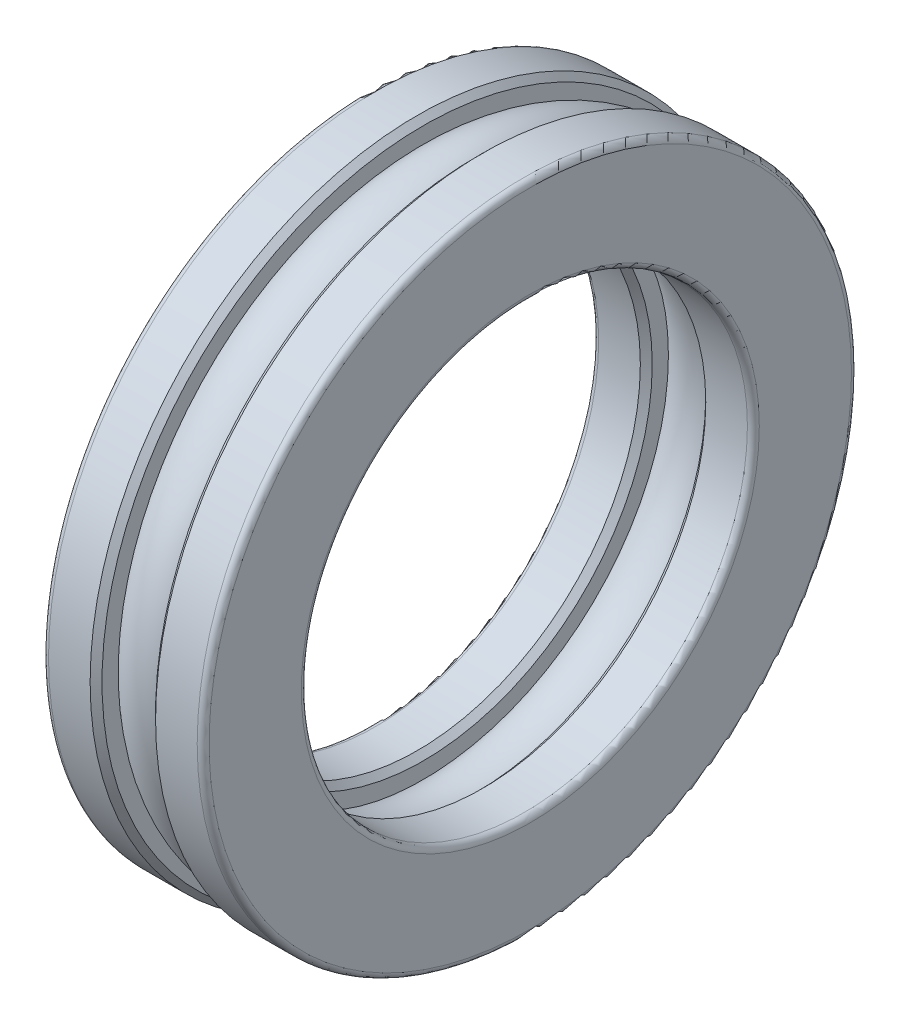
ISO-10303-21;
HEADER;
FILE_DESCRIPTION(('STEP AP214'),'2;1');
FILE_NAME('part.step','',(''),(''),'','','');
FILE_SCHEMA(('AUTOMOTIVE_DESIGN { 1 0 10303 214 1 1 1 1 }'));
ENDSEC;
DATA;
#1=APPLICATION_CONTEXT('core data for automotive mechanical design processes');
#2=APPLICATION_PROTOCOL_DEFINITION('international standard','automotive_design',2000,#1);
#3=PRODUCT_CONTEXT('',#1,'mechanical');
#4=PRODUCT('Part','Part','',(#3));
#5=PRODUCT_RELATED_PRODUCT_CATEGORY('part','',(#4));
#6=PRODUCT_DEFINITION_FORMATION('','',#4);
#7=PRODUCT_DEFINITION_CONTEXT('part definition',#1,'design');
#8=PRODUCT_DEFINITION('design','',#6,#7);
#9=PRODUCT_DEFINITION_SHAPE('','',#8);
#10=(LENGTH_UNIT() NAMED_UNIT(*) SI_UNIT(.MILLI.,.METRE.));
#11=(NAMED_UNIT(*) PLANE_ANGLE_UNIT() SI_UNIT($,.RADIAN.));
#12=(NAMED_UNIT(*) SI_UNIT($,.STERADIAN.) SOLID_ANGLE_UNIT());
#13=UNCERTAINTY_MEASURE_WITH_UNIT(LENGTH_MEASURE(1.E-05),#10,'distance_accuracy_value','');
#14=(GEOMETRIC_REPRESENTATION_CONTEXT(3) GLOBAL_UNCERTAINTY_ASSIGNED_CONTEXT((#13)) GLOBAL_UNIT_ASSIGNED_CONTEXT((#10,
#11,#12)) REPRESENTATION_CONTEXT('',''));
#15=CARTESIAN_POINT('',(0.,0.,0.));
#16=DIRECTION('',(0.,0.,1.));
#17=DIRECTION('',(1.,0.,0.));
#18=AXIS2_PLACEMENT_3D('',#15,#16,#17);
#19=CARTESIAN_POINT('',(13.5,0.,0.));
#20=DIRECTION('',(-1.,0.,0.));
#21=DIRECTION('',(0.,0.,1.));
#22=AXIS2_PLACEMENT_3D('',#19,#20,#21);
#23=TOROIDAL_SURFACE('',#22,46.25,6.75);
#24=CARTESIAN_POINT('',(17.9999999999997,0.,0.));
#25=DIRECTION('',(1.,0.,0.));
#26=DIRECTION('',(0.,0.,-1.));
#27=AXIS2_PLACEMENT_3D('',#24,#25,#26);
#28=CIRCLE('',#27,51.2811529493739);
#29=CARTESIAN_POINT('',(17.9999999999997,0.,-51.2811529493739));
#30=VERTEX_POINT('',#29);
#31=EDGE_CURVE('E91',#30,#30,#28,.T.);
#32=ORIENTED_EDGE('',*,*,#31,.F.);
#33=EDGE_LOOP('',(#32));
#34=FACE_BOUND('',#33,.T.);
#35=CARTESIAN_POINT('',(9.00000000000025,0.,0.));
#36=DIRECTION('',(1.,0.,0.));
#37=DIRECTION('',(0.,0.,-1.));
#38=AXIS2_PLACEMENT_3D('',#35,#36,#37);
#39=CIRCLE('',#38,51.2811529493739);
#40=CARTESIAN_POINT('',(9.00000000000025,0.,-51.2811529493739));
#41=VERTEX_POINT('',#40);
#42=EDGE_CURVE('E61',#41,#41,#39,.T.);
#43=ORIENTED_EDGE('',*,*,#42,.T.);
#44=EDGE_LOOP('',(#43));
#45=FACE_BOUND('',#44,.T.);
#46=ADVANCED_FACE('F32',(#34,#45),#23,.T.);
#47=CARTESIAN_POINT('',(8.,0.,0.));
#48=DIRECTION('',(1.,0.,0.));
#49=DIRECTION('',(0.,0.,-1.));
#50=AXIS2_PLACEMENT_3D('',#47,#48,#49);
#51=CONICAL_SURFACE('',#50,37.5,0.785398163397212);
#52=CARTESIAN_POINT('',(9.00000000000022,0.,0.));
#53=DIRECTION('',(1.,0.,0.));
#54=DIRECTION('',(0.,0.,-1.));
#55=AXIS2_PLACEMENT_3D('',#52,#53,#54);
#56=CIRCLE('',#55,38.4999999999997);
#57=CARTESIAN_POINT('',(9.00000000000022,0.,-38.4999999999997));
#58=VERTEX_POINT('',#57);
#59=EDGE_CURVE('E64',#58,#58,#56,.T.);
#60=ORIENTED_EDGE('',*,*,#59,.T.);
#61=EDGE_LOOP('',(#60));
#62=FACE_BOUND('',#61,.T.);
#63=CARTESIAN_POINT('',(8.,0.,0.));
#64=DIRECTION('',(1.,0.,0.));
#65=DIRECTION('',(0.,0.,-1.));
#66=AXIS2_PLACEMENT_3D('',#63,#64,#65);
#67=CIRCLE('',#66,37.5);
#68=CARTESIAN_POINT('',(8.,0.,-37.5));
#69=VERTEX_POINT('',#68);
#70=EDGE_CURVE('E10',#69,#69,#67,.T.);
#71=ORIENTED_EDGE('',*,*,#70,.F.);
#72=EDGE_LOOP('',(#71));
#73=FACE_BOUND('',#72,.T.);
#74=ADVANCED_FACE('F34',(#62,#73),#51,.F.);
#75=CARTESIAN_POINT('',(0.,0.,0.));
#76=DIRECTION('',(1.,0.,0.));
#77=DIRECTION('',(0.,0.,-1.));
#78=AXIS2_PLACEMENT_3D('',#75,#76,#77);
#79=CYLINDRICAL_SURFACE('',#78,37.4999999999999);
#80=ORIENTED_EDGE('',*,*,#70,.T.);
#81=EDGE_LOOP('',(#80));
#82=FACE_BOUND('',#81,.T.);
#83=CARTESIAN_POINT('',(1.00000000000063,0.,0.));
#84=DIRECTION('',(1.,0.,0.));
#85=DIRECTION('',(0.,0.,-1.));
#86=AXIS2_PLACEMENT_3D('',#83,#84,#85);
#87=CIRCLE('',#86,37.4999999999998);
#88=CARTESIAN_POINT('',(1.00000000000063,0.,-37.4999999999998));
#89=VERTEX_POINT('',#88);
#90=EDGE_CURVE('E39',#89,#89,#87,.T.);
#91=ORIENTED_EDGE('',*,*,#90,.F.);
#92=EDGE_LOOP('',(#91));
#93=FACE_BOUND('',#92,.T.);
#94=ADVANCED_FACE('F186',(#82,#93),#79,.F.);
#95=CARTESIAN_POINT('',(1.00000000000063,0.,0.));
#96=DIRECTION('',(1.,0.,0.));
#97=DIRECTION('',(0.,0.,-1.));
#98=AXIS2_PLACEMENT_3D('',#95,#96,#97);
#99=TOROIDAL_SURFACE('',#98,38.4999999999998,1.);
#100=ORIENTED_EDGE('',*,*,#90,.T.);
#101=EDGE_LOOP('',(#100));
#102=FACE_BOUND('',#101,.T.);
#103=CARTESIAN_POINT('',(6.31656185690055E-13,0.,0.));
#104=DIRECTION('',(1.,0.,0.));
#105=DIRECTION('',(0.,0.,-1.));
#106=AXIS2_PLACEMENT_3D('',#103,#104,#105);
#107=CIRCLE('',#106,38.4999999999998);
#108=CARTESIAN_POINT('',(6.31656185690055E-13,0.,-38.4999999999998));
#109=VERTEX_POINT('',#108);
#110=EDGE_CURVE('E43',#109,#109,#107,.T.);
#111=ORIENTED_EDGE('',*,*,#110,.F.);
#112=EDGE_LOOP('',(#111));
#113=FACE_BOUND('',#112,.T.);
#114=ADVANCED_FACE('F183',(#102,#113),#99,.T.);
#115=CARTESIAN_POINT('',(6.30463563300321E-13,53.9999999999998,0.));
#116=DIRECTION('',(-1.,0.,0.));
#117=DIRECTION('',(0.,0.,1.));
#118=AXIS2_PLACEMENT_3D('',#115,#116,#117);
#119=PLANE('',#118);
#120=ORIENTED_EDGE('',*,*,#110,.T.);
#121=EDGE_LOOP('',(#120));
#122=FACE_BOUND('',#121,.T.);
#123=CARTESIAN_POINT('',(6.29270940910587E-13,0.,0.));
#124=DIRECTION('',(1.,0.,0.));
#125=DIRECTION('',(0.,0.,-1.));
#126=AXIS2_PLACEMENT_3D('',#123,#124,#125);
#127=CIRCLE('',#126,53.9999999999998);
#128=CARTESIAN_POINT('',(6.29270940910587E-13,0.,-53.9999999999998));
#129=VERTEX_POINT('',#128);
#130=EDGE_CURVE('E47',#129,#129,#127,.T.);
#131=ORIENTED_EDGE('',*,*,#130,.F.);
#132=EDGE_LOOP('',(#131));
#133=FACE_BOUND('',#132,.T.);
#134=ADVANCED_FACE('F179',(#122,#133),#119,.T.);
#135=CARTESIAN_POINT('',(1.00000000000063,0.,0.));
#136=DIRECTION('',(1.,0.,0.));
#137=DIRECTION('',(0.,0.,-1.));
#138=AXIS2_PLACEMENT_3D('',#135,#136,#137);
#139=TOROIDAL_SURFACE('',#138,53.9999999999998,1.);
#140=ORIENTED_EDGE('',*,*,#130,.T.);
#141=EDGE_LOOP('',(#140));
#142=FACE_BOUND('',#141,.T.);
#143=CARTESIAN_POINT('',(1.00000000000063,0.,0.));
#144=DIRECTION('',(1.,0.,0.));
#145=DIRECTION('',(0.,0.,-1.));
#146=AXIS2_PLACEMENT_3D('',#143,#144,#145);
#147=CIRCLE('',#146,54.9999999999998);
#148=CARTESIAN_POINT('',(1.00000000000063,0.,-54.9999999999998));
#149=VERTEX_POINT('',#148);
#150=EDGE_CURVE('E52',#149,#149,#147,.T.);
#151=ORIENTED_EDGE('',*,*,#150,.F.);
#152=EDGE_LOOP('',(#151));
#153=FACE_BOUND('',#152,.T.);
#154=ADVANCED_FACE('F175',(#142,#153),#139,.T.);
#155=CARTESIAN_POINT('',(0.,0.,0.));
#156=DIRECTION('',(1.,0.,0.));
#157=DIRECTION('',(0.,0.,-1.));
#158=AXIS2_PLACEMENT_3D('',#155,#156,#157);
#159=CYLINDRICAL_SURFACE('',#158,54.9999999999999);
#160=ORIENTED_EDGE('',*,*,#150,.T.);
#161=EDGE_LOOP('',(#160));
#162=FACE_BOUND('',#161,.T.);
#163=CARTESIAN_POINT('',(7.99999999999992,0.,0.));
#164=DIRECTION('',(1.,0.,0.));
#165=DIRECTION('',(0.,0.,-1.));
#166=AXIS2_PLACEMENT_3D('',#163,#164,#165);
#167=CIRCLE('',#166,54.9999999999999);
#168=CARTESIAN_POINT('',(7.99999999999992,0.,-54.9999999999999));
#169=VERTEX_POINT('',#168);
#170=EDGE_CURVE('E55',#169,#169,#167,.T.);
#171=ORIENTED_EDGE('',*,*,#170,.F.);
#172=EDGE_LOOP('',(#171));
#173=FACE_BOUND('',#172,.T.);
#174=ADVANCED_FACE('F169',(#162,#173),#159,.T.);
#175=CARTESIAN_POINT('',(9.00000000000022,0.,0.));
#176=DIRECTION('',(-1.,0.,0.));
#177=DIRECTION('',(0.,0.,1.));
#178=AXIS2_PLACEMENT_3D('',#175,#176,#177);
#179=CONICAL_SURFACE('',#178,54.0000000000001,0.785398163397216);
#180=ORIENTED_EDGE('',*,*,#170,.T.);
#181=EDGE_LOOP('',(#180));
#182=FACE_BOUND('',#181,.T.);
#183=CARTESIAN_POINT('',(9.00000000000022,0.,0.));
#184=DIRECTION('',(1.,0.,0.));
#185=DIRECTION('',(0.,0.,-1.));
#186=AXIS2_PLACEMENT_3D('',#183,#184,#185);
#187=CIRCLE('',#186,54.0000000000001);
#188=CARTESIAN_POINT('',(9.00000000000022,0.,-54.0000000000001));
#189=VERTEX_POINT('',#188);
#190=EDGE_CURVE('E58',#189,#189,#187,.T.);
#191=ORIENTED_EDGE('',*,*,#190,.F.);
#192=EDGE_LOOP('',(#191));
#193=FACE_BOUND('',#192,.T.);
#194=ADVANCED_FACE('F160',(#182,#193),#179,.T.);
#195=CARTESIAN_POINT('',(9.00000000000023,51.2811529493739,0.));
#196=DIRECTION('',(1.,0.,0.));
#197=DIRECTION('',(0.,0.,-1.));
#198=AXIS2_PLACEMENT_3D('',#195,#196,#197);
#199=PLANE('',#198);
#200=ORIENTED_EDGE('',*,*,#190,.T.);
#201=EDGE_LOOP('',(#200));
#202=FACE_BOUND('',#201,.T.);
#203=ORIENTED_EDGE('',*,*,#42,.F.);
#204=EDGE_LOOP('',(#203));
#205=FACE_BOUND('',#204,.T.);
#206=ADVANCED_FACE('F157',(#202,#205),#199,.T.);
#207=CARTESIAN_POINT('',(9.00000000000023,38.4999999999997,0.));
#208=DIRECTION('',(1.,0.,0.));
#209=DIRECTION('',(0.,0.,-1.));
#210=AXIS2_PLACEMENT_3D('',#207,#208,#209);
#211=PLANE('',#210);
#212=CARTESIAN_POINT('',(9.00000000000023,0.,0.));
#213=DIRECTION('',(-1.,0.,0.));
#214=DIRECTION('',(0.,0.,1.));
#215=AXIS2_PLACEMENT_3D('',#212,#213,#214);
#216=CIRCLE('',#215,41.2188470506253);
#217=CARTESIAN_POINT('',(9.00000000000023,0.,41.2188470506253));
#218=VERTEX_POINT('',#217);
#219=EDGE_CURVE('E67',#218,#218,#216,.F.);
#220=ORIENTED_EDGE('',*,*,#219,.T.);
#221=EDGE_LOOP('',(#220));
#222=FACE_BOUND('',#221,.T.);
#223=ORIENTED_EDGE('',*,*,#59,.F.);
#224=EDGE_LOOP('',(#223));
#225=FACE_BOUND('',#224,.T.);
#226=ADVANCED_FACE('F159',(#222,#225),#211,.T.);
#227=CARTESIAN_POINT('',(17.9999999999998,0.,0.));
#228=DIRECTION('',(1.,0.,0.));
#229=DIRECTION('',(0.,0.,-1.));
#230=AXIS2_PLACEMENT_3D('',#227,#228,#229);
#231=CIRCLE('',#230,41.2188470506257);
#232=CARTESIAN_POINT('',(17.9999999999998,0.,-41.2188470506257));
#233=VERTEX_POINT('',#232);
#234=EDGE_CURVE('E94',#233,#233,#231,.T.);
#235=ORIENTED_EDGE('',*,*,#234,.T.);
#236=EDGE_LOOP('',(#235));
#237=FACE_BOUND('',#236,.T.);
#238=ORIENTED_EDGE('',*,*,#219,.F.);
#239=EDGE_LOOP('',(#238));
#240=FACE_BOUND('',#239,.T.);
#241=ADVANCED_FACE('F107',(#237,#240),#23,.T.);
#242=CARTESIAN_POINT('',(19.,0.,0.));
#243=DIRECTION('',(-1.,0.,0.));
#244=DIRECTION('',(0.,0.,-1.));
#245=AXIS2_PLACEMENT_3D('',#242,#243,#244);
#246=CONICAL_SURFACE('',#245,37.5,0.785398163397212);
#247=CARTESIAN_POINT('',(17.9999999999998,0.,0.));
#248=DIRECTION('',(1.,0.,0.));
#249=DIRECTION('',(0.,0.,-1.));
#250=AXIS2_PLACEMENT_3D('',#247,#248,#249);
#251=CIRCLE('',#250,38.4999999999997);
#252=CARTESIAN_POINT('',(17.9999999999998,0.,-38.4999999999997));
#253=VERTEX_POINT('',#252);
#254=EDGE_CURVE('E97',#253,#253,#251,.T.);
#255=ORIENTED_EDGE('',*,*,#254,.F.);
#256=EDGE_LOOP('',(#255));
#257=FACE_BOUND('',#256,.T.);
#258=CARTESIAN_POINT('',(19.,0.,0.));
#259=DIRECTION('',(1.,0.,0.));
#260=DIRECTION('',(0.,0.,-1.));
#261=AXIS2_PLACEMENT_3D('',#258,#259,#260);
#262=CIRCLE('',#261,37.5);
#263=CARTESIAN_POINT('',(19.,0.,-37.5));
#264=VERTEX_POINT('',#263);
#265=EDGE_CURVE('E70',#264,#264,#262,.T.);
#266=ORIENTED_EDGE('',*,*,#265,.T.);
#267=EDGE_LOOP('',(#266));
#268=FACE_BOUND('',#267,.T.);
#269=ADVANCED_FACE('F103',(#257,#268),#246,.F.);
#270=CARTESIAN_POINT('',(27.,0.,0.));
#271=DIRECTION('',(-1.,0.,0.));
#272=DIRECTION('',(0.,0.,-1.));
#273=AXIS2_PLACEMENT_3D('',#270,#271,#272);
#274=CYLINDRICAL_SURFACE('',#273,37.4999999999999);
#275=ORIENTED_EDGE('',*,*,#265,.F.);
#276=EDGE_LOOP('',(#275));
#277=FACE_BOUND('',#276,.T.);
#278=CARTESIAN_POINT('',(25.9999999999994,0.,0.));
#279=DIRECTION('',(1.,0.,0.));
#280=DIRECTION('',(0.,0.,-1.));
#281=AXIS2_PLACEMENT_3D('',#278,#279,#280);
#282=CIRCLE('',#281,37.4999999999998);
#283=CARTESIAN_POINT('',(25.9999999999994,0.,-37.4999999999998));
#284=VERTEX_POINT('',#283);
#285=EDGE_CURVE('E73',#284,#284,#282,.T.);
#286=ORIENTED_EDGE('',*,*,#285,.T.);
#287=EDGE_LOOP('',(#286));
#288=FACE_BOUND('',#287,.T.);
#289=ADVANCED_FACE('F106',(#277,#288),#274,.F.);
#290=CARTESIAN_POINT('',(25.9999999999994,0.,0.));
#291=DIRECTION('',(-1.,0.,0.));
#292=DIRECTION('',(0.,0.,-1.));
#293=AXIS2_PLACEMENT_3D('',#290,#291,#292);
#294=TOROIDAL_SURFACE('',#293,38.4999999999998,1.);
#295=ORIENTED_EDGE('',*,*,#285,.F.);
#296=EDGE_LOOP('',(#295));
#297=FACE_BOUND('',#296,.T.);
#298=CARTESIAN_POINT('',(26.9999999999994,0.,0.));
#299=DIRECTION('',(1.,0.,0.));
#300=DIRECTION('',(0.,0.,-1.));
#301=AXIS2_PLACEMENT_3D('',#298,#299,#300);
#302=CIRCLE('',#301,38.4999999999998);
#303=CARTESIAN_POINT('',(26.9999999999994,0.,-38.4999999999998));
#304=VERTEX_POINT('',#303);
#305=EDGE_CURVE('E76',#304,#304,#302,.T.);
#306=ORIENTED_EDGE('',*,*,#305,.T.);
#307=EDGE_LOOP('',(#306));
#308=FACE_BOUND('',#307,.T.);
#309=ADVANCED_FACE('F113',(#297,#308),#294,.T.);
#310=CARTESIAN_POINT('',(26.9999999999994,53.9999999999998,0.));
#311=DIRECTION('',(1.,0.,0.));
#312=DIRECTION('',(0.,0.,1.));
#313=AXIS2_PLACEMENT_3D('',#310,#311,#312);
#314=PLANE('',#313);
#315=ORIENTED_EDGE('',*,*,#305,.F.);
#316=EDGE_LOOP('',(#315));
#317=FACE_BOUND('',#316,.T.);
#318=CARTESIAN_POINT('',(26.9999999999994,0.,0.));
#319=DIRECTION('',(1.,0.,0.));
#320=DIRECTION('',(0.,0.,-1.));
#321=AXIS2_PLACEMENT_3D('',#318,#319,#320);
#322=CIRCLE('',#321,53.9999999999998);
#323=CARTESIAN_POINT('',(26.9999999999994,0.,-53.9999999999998));
#324=VERTEX_POINT('',#323);
#325=EDGE_CURVE('E79',#324,#324,#322,.T.);
#326=ORIENTED_EDGE('',*,*,#325,.T.);
#327=EDGE_LOOP('',(#326));
#328=FACE_BOUND('',#327,.T.);
#329=ADVANCED_FACE('F119',(#317,#328),#314,.T.);
#330=CARTESIAN_POINT('',(25.9999999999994,0.,0.));
#331=DIRECTION('',(-1.,0.,0.));
#332=DIRECTION('',(0.,0.,-1.));
#333=AXIS2_PLACEMENT_3D('',#330,#331,#332);
#334=TOROIDAL_SURFACE('',#333,53.9999999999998,1.);
#335=ORIENTED_EDGE('',*,*,#325,.F.);
#336=EDGE_LOOP('',(#335));
#337=FACE_BOUND('',#336,.T.);
#338=CARTESIAN_POINT('',(25.9999999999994,0.,0.));
#339=DIRECTION('',(1.,0.,0.));
#340=DIRECTION('',(0.,0.,-1.));
#341=AXIS2_PLACEMENT_3D('',#338,#339,#340);
#342=CIRCLE('',#341,54.9999999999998);
#343=CARTESIAN_POINT('',(25.9999999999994,0.,-54.9999999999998));
#344=VERTEX_POINT('',#343);
#345=EDGE_CURVE('E82',#344,#344,#342,.T.);
#346=ORIENTED_EDGE('',*,*,#345,.T.);
#347=EDGE_LOOP('',(#346));
#348=FACE_BOUND('',#347,.T.);
#349=ADVANCED_FACE('F125',(#337,#348),#334,.T.);
#350=CARTESIAN_POINT('',(27.,0.,0.));
#351=DIRECTION('',(-1.,0.,0.));
#352=DIRECTION('',(0.,0.,-1.));
#353=AXIS2_PLACEMENT_3D('',#350,#351,#352);
#354=CYLINDRICAL_SURFACE('',#353,54.9999999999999);
#355=ORIENTED_EDGE('',*,*,#345,.F.);
#356=EDGE_LOOP('',(#355));
#357=FACE_BOUND('',#356,.T.);
#358=CARTESIAN_POINT('',(19.0000000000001,0.,0.));
#359=DIRECTION('',(1.,0.,0.));
#360=DIRECTION('',(0.,0.,-1.));
#361=AXIS2_PLACEMENT_3D('',#358,#359,#360);
#362=CIRCLE('',#361,54.9999999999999);
#363=CARTESIAN_POINT('',(19.0000000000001,0.,-54.9999999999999));
#364=VERTEX_POINT('',#363);
#365=EDGE_CURVE('E85',#364,#364,#362,.T.);
#366=ORIENTED_EDGE('',*,*,#365,.T.);
#367=EDGE_LOOP('',(#366));
#368=FACE_BOUND('',#367,.T.);
#369=ADVANCED_FACE('F131',(#357,#368),#354,.T.);
#370=CARTESIAN_POINT('',(17.9999999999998,0.,0.));
#371=DIRECTION('',(1.,0.,0.));
#372=DIRECTION('',(0.,0.,1.));
#373=AXIS2_PLACEMENT_3D('',#370,#371,#372);
#374=CONICAL_SURFACE('',#373,54.0000000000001,0.785398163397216);
#375=ORIENTED_EDGE('',*,*,#365,.F.);
#376=EDGE_LOOP('',(#375));
#377=FACE_BOUND('',#376,.T.);
#378=CARTESIAN_POINT('',(17.9999999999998,0.,0.));
#379=DIRECTION('',(1.,0.,0.));
#380=DIRECTION('',(0.,0.,-1.));
#381=AXIS2_PLACEMENT_3D('',#378,#379,#380);
#382=CIRCLE('',#381,54.0000000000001);
#383=CARTESIAN_POINT('',(17.9999999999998,0.,-54.0000000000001));
#384=VERTEX_POINT('',#383);
#385=EDGE_CURVE('E88',#384,#384,#382,.T.);
#386=ORIENTED_EDGE('',*,*,#385,.T.);
#387=EDGE_LOOP('',(#386));
#388=FACE_BOUND('',#387,.T.);
#389=ADVANCED_FACE('F137',(#377,#388),#374,.T.);
#390=CARTESIAN_POINT('',(17.9999999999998,51.2811529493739,0.));
#391=DIRECTION('',(-1.,0.,0.));
#392=DIRECTION('',(0.,0.,-1.));
#393=AXIS2_PLACEMENT_3D('',#390,#391,#392);
#394=PLANE('',#393);
#395=ORIENTED_EDGE('',*,*,#385,.F.);
#396=EDGE_LOOP('',(#395));
#397=FACE_BOUND('',#396,.T.);
#398=ORIENTED_EDGE('',*,*,#31,.T.);
#399=EDGE_LOOP('',(#398));
#400=FACE_BOUND('',#399,.T.);
#401=ADVANCED_FACE('F143',(#397,#400),#394,.T.);
#402=CARTESIAN_POINT('',(17.9999999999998,38.4999999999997,0.));
#403=DIRECTION('',(-1.,0.,0.));
#404=DIRECTION('',(0.,0.,-1.));
#405=AXIS2_PLACEMENT_3D('',#402,#403,#404);
#406=PLANE('',#405);
#407=ORIENTED_EDGE('',*,*,#234,.F.);
#408=EDGE_LOOP('',(#407));
#409=FACE_BOUND('',#408,.T.);
#410=ORIENTED_EDGE('',*,*,#254,.T.);
#411=EDGE_LOOP('',(#410));
#412=FACE_BOUND('',#411,.T.);
#413=ADVANCED_FACE('F101',(#409,#412),#406,.T.);
#414=CLOSED_SHELL('',(#46,#74,#94,#114,#134,#154,#174,#194,#206,#226,#241,#269,#289,#309,#329,
#349,#369,#389,#401,#413));
#415=MANIFOLD_SOLID_BREP('B2',#414);
#416=ADVANCED_BREP_SHAPE_REPRESENTATION('',(#18,#415),#14);
#417=SHAPE_DEFINITION_REPRESENTATION(#9,#416);
ENDSEC;
END-ISO-10303-21;
